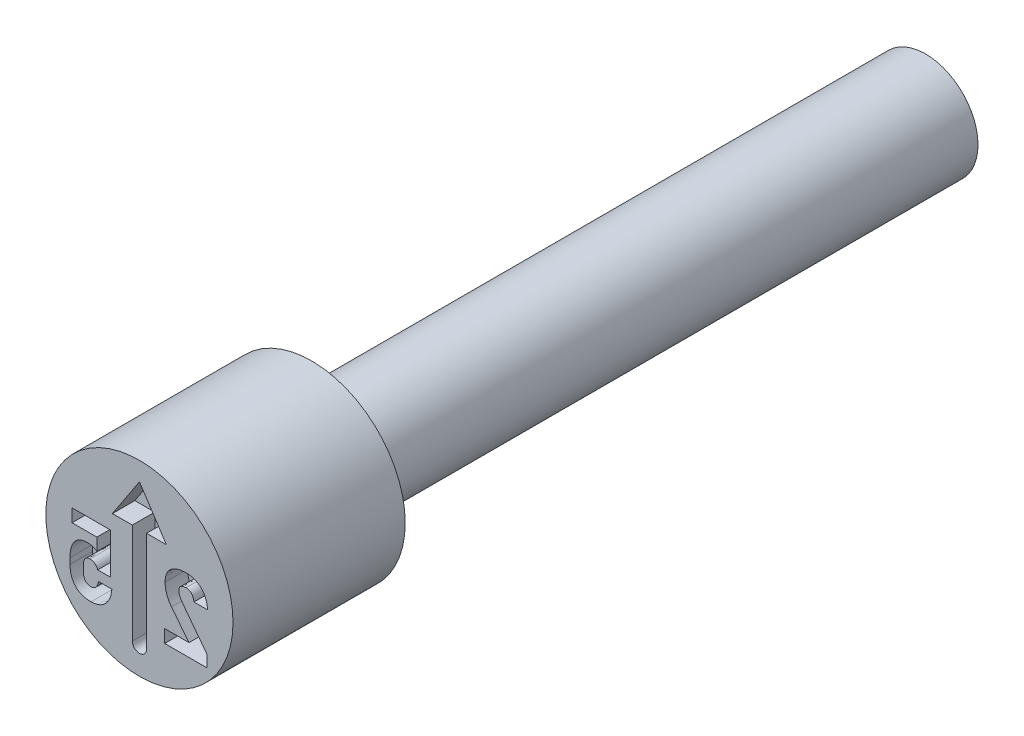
from build123d import *

# Parameters (mm, degrees)
CUT_EXTRUDE4_DEPTH = 0.3
CUT_EXTRUDE5_DEPTH = 0.3


with BuildPart() as part:
    # Sketch2 → Revolve1 (revolve)
    with BuildSketch(Plane(origin=(0, 0, 0), x_dir=(0, 0, -1), z_dir=(1, 0, 0)), mode=Mode.PRIVATE) as revolve1_sk:
        Polygon((0, 1.25), (0, 0), (10.5, 0), (10.5, 0.7), (2.3, 0.7), (2.3, 1.25), align=None)
    revolve(revolve1_sk.sketch.rotate(Axis((0, 0, -0.403888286), (0, 0, -1)), 90), axis=Axis((0, 0, -0.403888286), (0, 0, -1)))

    # Sketch3 → Cut-Extrude4 (cut)
    with BuildSketch(Plane.XY):
        with BuildLine():
            Line((0.095236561, 0.453175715), (0.095236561, -0.888080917))
            ThreePointArc((0.095236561, -0.888080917), (0, -0.983317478), (-0.095236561, -0.888080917))
            Line((-0.095236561, -0.888080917), (-0.095236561, 0.453175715))
            Line((-0.095236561, 0.453175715), (-0.360958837, 0.453175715))
            Line((-0.360958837, 0.453175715), (0, 1.001057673))
            Line((0, 1.001057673), (0.360958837, 0.453175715))
            Line((0.360958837, 0.453175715), (0.095236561, 0.453175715))
        make_face()
    extrude(amount=-CUT_EXTRUDE4_DEPTH, mode=Mode.SUBTRACT)

    # Sketch4 → Cut-Extrude5 (cut)
    with BuildSketch(Plane.XY):
        with BuildLine():
            Line((0.899358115, -0.538536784), (0.573334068, -0.109904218))
            add(Edge.make_bspline(
                [(0.573334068, -0.109904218), (0.566496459, -0.10041768), (0.553148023, -0.081897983), (0.541205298, -0.05635414), (0.533618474, -0.036325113), (0.530110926, -0.02179639), (0.527514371, -0.007903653), (0.527211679, 0.001211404), (0.527063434, 0.005675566)],
                knots=[0, 0, 0, 0, 1.660423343, 3.241491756, 3.993801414, 4.704207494, 5.365376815, 6, 6, 6, 6], degree=3))
            Line((0.527063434, 0.005675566), (0.527063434, 0.007030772))
            add(Edge.make_bspline(
                [(0.527063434, 0.007030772), (0.527323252, 0.013130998), (0.527818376, 0.024755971), (0.532598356, 0.041111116), (0.540502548, 0.055253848), (0.551574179, 0.067109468), (0.565657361, 0.07622106), (0.582269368, 0.082877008), (0.601498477, 0.086643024), (0.615135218, 0.08712265), (0.622315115, 0.087375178)],
                knots=[0, 0, 0, 0, 1.033361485, 1.969238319, 2.861873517, 3.760870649, 4.693536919, 5.686153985, 6.781734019, 8, 8, 8, 8], degree=3))
            add(Edge.make_bspline(
                [(0.622315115, 0.087375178), (0.62938521, 0.087076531), (0.643106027, 0.086496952), (0.662623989, 0.08097414), (0.679962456, 0.07159799), (0.694971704, 0.058639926), (0.707565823, 0.042338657), (0.716848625, 0.022700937), (0.724324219, 0.000381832), (0.726493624, -0.015817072), (0.727634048, -0.024332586)],
                knots=[0, 0, 0, 0, 0.993701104, 1.928459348, 2.826878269, 3.748294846, 4.700551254, 5.70417143, 6.793118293, 8, 8, 8, 8], degree=3))
            Line((0.727634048, -0.024332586), (0.911167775, -0.02510699))
            add(Edge.make_bspline(
                [(0.911167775, -0.02510699), (0.909852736, -0.010030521), (0.90729096, 0.017830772), (0.898580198, 0.057897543), (0.885711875, 0.094764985), (0.869270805, 0.128534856), (0.849111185, 0.158780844), (0.825720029, 0.185494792), (0.798838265, 0.208157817), (0.76893152, 0.226989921), (0.736130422, 0.24172795), (0.700836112, 0.252466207), (0.662995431, 0.258656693), (0.636986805, 0.259461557), (0.623670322, 0.25987365)],
                knots=[0, 0, 0, 0, 1.143950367, 2.228484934, 3.258162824, 4.249580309, 5.213917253, 6.146796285, 7.070112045, 8.006232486, 8.954636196, 9.927630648, 10.9389416, 12, 12, 12, 12], degree=3))
            add(Edge.make_bspline(
                [(0.623670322, 0.25987365), (0.609390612, 0.259575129), (0.581753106, 0.25899736), (0.541956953, 0.253558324), (0.505363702, 0.244507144), (0.472065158, 0.231790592), (0.442279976, 0.215443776), (0.415870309, 0.196040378), (0.393581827, 0.172827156), (0.375042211, 0.14645659), (0.36042731, 0.117030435), (0.350192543, 0.084574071), (0.343924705, 0.049348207), (0.343152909, 0.024868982), (0.342755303, 0.012257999)],
                knots=[0, 0, 0, 0, 1.208591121, 2.339154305, 3.392741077, 4.394302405, 5.348037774, 6.261656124, 7.158186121, 8.060194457, 8.981460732, 9.928425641, 10.932785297, 12, 12, 12, 12], degree=3))
            add(Edge.make_bspline(
                [(0.342755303, 0.012257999), (0.343003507, 0.000692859), (0.343500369, -0.020908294), (0.34793173, -0.053179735), (0.355177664, -0.085264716), (0.36500942, -0.117050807), (0.377286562, -0.148007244), (0.391938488, -0.177640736), (0.408666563, -0.205875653), (0.421774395, -0.223337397), (0.428326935, -0.232066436)],
                knots=[0, 0, 0, 0, 0.985191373, 1.972179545, 2.968870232, 3.986806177, 5.007996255, 6.007036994, 7.003727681, 8, 8, 8, 8], degree=3))
            Line((0.428326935, -0.232066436), (0.662196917, -0.527501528))
            Line((0.662196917, -0.527501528), (0.337528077, -0.527501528))
            Line((0.337528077, -0.527501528), (0.337528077, -0.7))
            Line((0.337528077, -0.7), (0.899358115, -0.7))
            Line((0.899358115, -0.7), (0.899358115, -0.538536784))
        make_face()
        with BuildLine():
            add(Edge.make_bspline(
                [(-0.647157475, -0.70987365), (-0.634671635, -0.709492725), (-0.610238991, -0.708747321), (-0.574624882, -0.702055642), (-0.54086155, -0.691692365), (-0.509200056, -0.676908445), (-0.479984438, -0.658125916), (-0.453860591, -0.635158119), (-0.4305889, -0.608606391), (-0.410636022, -0.578238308), (-0.394204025, -0.544378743), (-0.381411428, -0.507426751), (-0.372624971, -0.467448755), (-0.370070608, -0.439712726), (-0.368759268, -0.425473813)],
                knots=[0, 0, 0, 0, 1.013165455, 1.982590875, 2.932437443, 3.87502652, 4.811241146, 5.743574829, 6.690699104, 7.67044025, 8.68537997, 9.739549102, 10.839546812, 12, 12, 12, 12], degree=3))
            Line((-0.368759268, -0.425473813), (-0.547840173, -0.42489301))
            add(Edge.make_bspline(
                [(-0.547840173, -0.42489301), (-0.548862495, -0.433788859), (-0.550810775, -0.449635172), (-0.557836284, -0.47162534), (-0.56700854, -0.490954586), (-0.579124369, -0.50717354), (-0.593511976, -0.520341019), (-0.610560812, -0.529271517), (-0.629403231, -0.535230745), (-0.642785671, -0.535751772), (-0.649674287, -0.536019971)],
                knots=[0, 0, 0, 0, 1.202223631, 2.291125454, 3.30376979, 4.265156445, 5.185306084, 6.082185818, 7.012804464, 8, 8, 8, 8], degree=3))
            add(Edge.make_bspline(
                [(-0.649674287, -0.536019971), (-0.657140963, -0.535694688), (-0.671422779, -0.535072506), (-0.691441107, -0.529067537), (-0.708867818, -0.519453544), (-0.723262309, -0.505619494), (-0.734745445, -0.488382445), (-0.742873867, -0.467741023), (-0.747687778, -0.444022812), (-0.748161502, -0.427175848), (-0.748410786, -0.418310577)],
                knots=[0, 0, 0, 0, 1.026088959, 1.96264217, 2.850204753, 3.743092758, 4.68486217, 5.681854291, 6.780136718, 8, 8, 8, 8], degree=3))
            Line((-0.748410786, -0.418310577), (-0.748410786, -0.338740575))
            add(Edge.make_bspline(
                [(-0.748410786, -0.338740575), (-0.748219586, -0.329875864), (-0.747856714, -0.31305193), (-0.74334261, -0.289517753), (-0.73632407, -0.268984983), (-0.725958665, -0.251940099), (-0.713073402, -0.23818223), (-0.697480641, -0.228410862), (-0.679493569, -0.222639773), (-0.66675462, -0.221963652), (-0.66012874, -0.221611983)],
                knots=[0, 0, 0, 0, 1.281587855, 2.432267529, 3.454745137, 4.406485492, 5.298532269, 6.159104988, 7.042499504, 8, 8, 8, 8], degree=3))
            add(Edge.make_bspline(
                [(-0.66012874, -0.221611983), (-0.6539132, -0.221801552), (-0.641880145, -0.222168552), (-0.62455443, -0.225968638), (-0.608630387, -0.232186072), (-0.594288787, -0.240976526), (-0.581622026, -0.251750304), (-0.571193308, -0.264768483), (-0.562451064, -0.279478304), (-0.558803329, -0.290510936), (-0.556939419, -0.296148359)],
                knots=[0, 0, 0, 0, 1.085085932, 2.100686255, 3.083167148, 4.060192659, 5.028057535, 5.974180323, 6.964852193, 8, 8, 8, 8], degree=3))
            Line((-0.556939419, -0.296148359), (-0.389668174, -0.296148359))
            Line((-0.389668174, -0.296148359), (-0.389668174, 0.25))
            Line((-0.389668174, 0.25), (-0.900000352, 0.25))
            Line((-0.900000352, 0.25), (-0.900000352, 0.077501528))
            Line((-0.900000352, 0.077501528), (-0.568749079, 0.077501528))
            Line((-0.568749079, 0.077501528), (-0.568749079, -0.09035052))
            add(Edge.make_bspline(
                [(-0.568749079, -0.09035052), (-0.572353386, -0.087158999), (-0.579767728, -0.080593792), (-0.592730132, -0.072257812), (-0.607555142, -0.065177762), (-0.629430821, -0.057023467), (-0.658207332, -0.049772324), (-0.681830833, -0.048551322), (-0.693428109, -0.047951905)],
                knots=[0, 0, 0, 0, 0.643749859, 1.324243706, 2.054464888, 2.839075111, 4.448235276, 6, 6, 6, 6], degree=3))
            add(Edge.make_bspline(
                [(-0.693428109, -0.047951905), (-0.705334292, -0.048328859), (-0.728426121, -0.049059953), (-0.761734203, -0.055636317), (-0.792430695, -0.066172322), (-0.8202623, -0.081351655), (-0.8452605, -0.100376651), (-0.866973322, -0.123623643), (-0.885536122, -0.15071371), (-0.900728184, -0.181664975), (-0.912684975, -0.216206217), (-0.921369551, -0.254096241), (-0.926318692, -0.295371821), (-0.92696405, -0.323948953), (-0.92729809, -0.338740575)],
                knots=[0, 0, 0, 0, 1.012739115, 1.964189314, 2.878178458, 3.765675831, 4.65138573, 5.541464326, 6.461953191, 7.437418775, 8.467828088, 9.567356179, 10.740855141, 12, 12, 12, 12], degree=3))
            Line((-0.92729809, -0.338740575), (-0.92729809, -0.418310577))
            add(Edge.make_bspline(
                [(-0.92729809, -0.418310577), (-0.926873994, -0.433106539), (-0.926053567, -0.461729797), (-0.920186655, -0.503121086), (-0.90961027, -0.541088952), (-0.895439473, -0.575878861), (-0.876935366, -0.606799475), (-0.854777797, -0.634111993), (-0.828562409, -0.6571858), (-0.798907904, -0.676604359), (-0.765532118, -0.691497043), (-0.728968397, -0.702316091), (-0.689072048, -0.708751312), (-0.661443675, -0.709491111), (-0.647157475, -0.70987365)],
                knots=[0, 0, 0, 0, 1.159103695, 2.242322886, 3.265299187, 4.239894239, 5.17631577, 6.078070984, 6.98412447, 7.901225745, 8.844758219, 9.836512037, 10.881294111, 12, 12, 12, 12], degree=3))
        make_face()
    extrude(amount=-CUT_EXTRUDE5_DEPTH, mode=Mode.SUBTRACT)


solid = part.part
